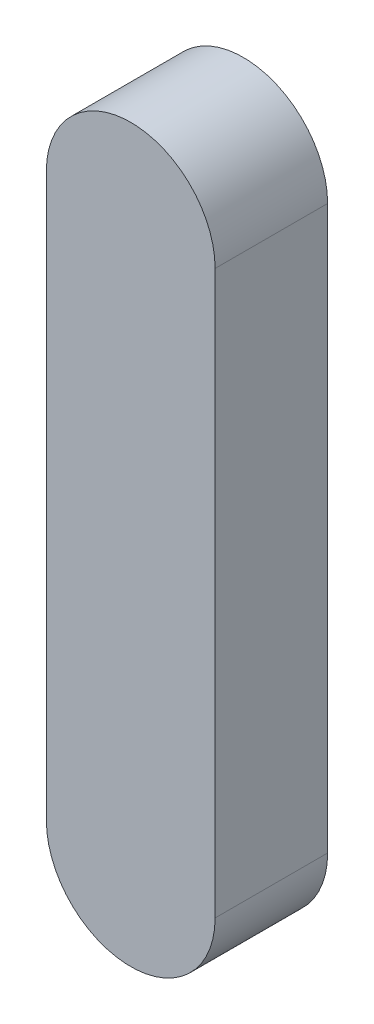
from build123d import *

# Parameters (mm, degrees)
EXTRUDE_1_DEPTH = 4


with BuildPart() as part:
    # Sketch 1 → Extrude 1 (new body)
    with BuildSketch(Plane.XY):
        with BuildLine():
            Line((7.5, -56), (7.5, -36))
            ThreePointArc((7.5, -36), (4.5, -33), (1.5, -36))
            Line((1.5, -36), (1.5, -56))
            ThreePointArc((1.5, -56), (4.5, -59), (7.5, -56))
        make_face()
    extrude(amount=EXTRUDE_1_DEPTH)


solid = part.part
